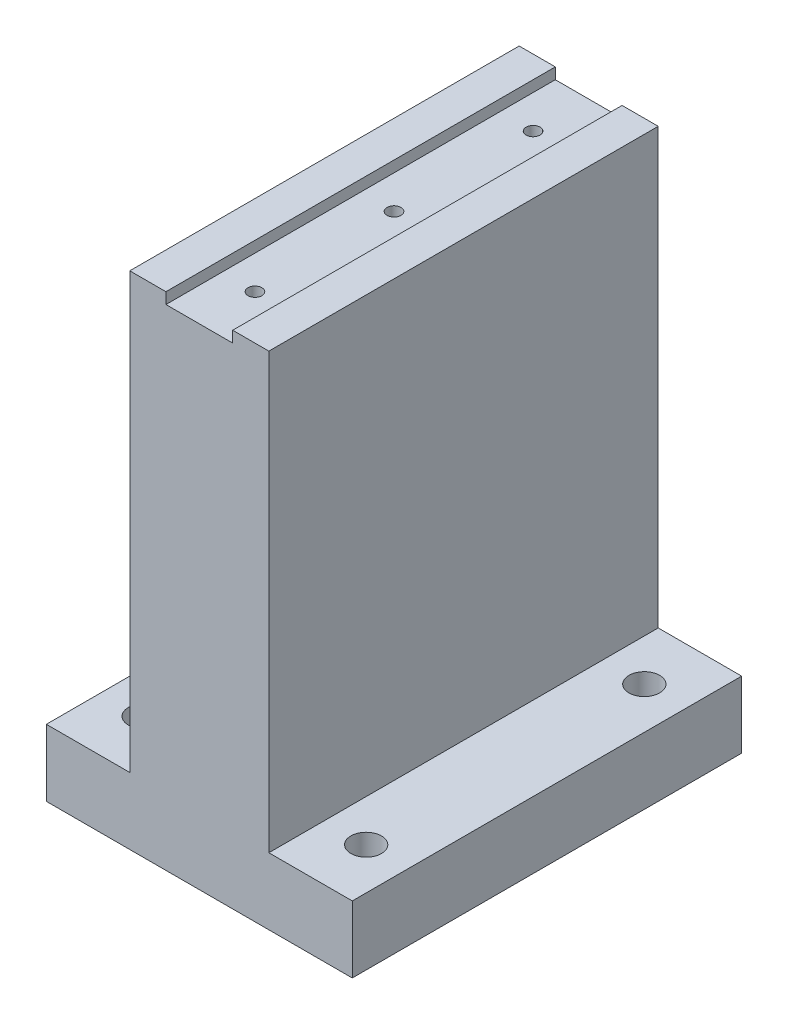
from build123d import *

# Parameters (mm, degrees)
EXTRUDE_1_DEPTH     = 70
SKETCH_2_R          = 2.75
CUT_EXTRUDE_1_DEPTH = 70
SKETCH_3_R          = 1.25
CUT_EXTRUDE_2_DEPTH = 15


with BuildPart() as part:
    # Sketch 1 → Extrude 1 (new body)
    with BuildSketch(Plane.XY):
        Polygon((21.5, 88.1), (21.5, 90.1), (15, 90.1), (15, 12), (0, 12), (0, 0), (55, 0), (55, 12), (40, 12), (40, 90.1), (33.5, 90.1), (33.5, 88.1), align=None)
    extrude(amount=EXTRUDE_1_DEPTH)

    # Sketch 2 → Cut-Extrude 1 (cut)
    with BuildSketch(Plane(origin=(0, 12, 0), x_dir=(1, 0, 0), z_dir=(0, 1, 0))):
        with Locations(Location((7.5, -10, 0), (0, 0, 270))):
            Circle(SKETCH_2_R)
        with Locations(Location((47.5, -10, 0), (0, 0, 270))):
            Circle(SKETCH_2_R)
        with Locations(Location((47.5, -60, 0), (0, 0, 270))):
            Circle(SKETCH_2_R)
        with Locations(Location((7.5, -60, 0), (0, 0, 270))):
            Circle(SKETCH_2_R)
    extrude(amount=-CUT_EXTRUDE_1_DEPTH, mode=Mode.SUBTRACT)

    # Sketch 3 → Cut-Extrude 2 (cut)
    with BuildSketch(Plane(origin=(0, 88.1, 0), x_dir=(1, 0, 0), z_dir=(0, 1, 0))):
        with Locations(Location((27.5, -10, 0), (0, 0, 270))):
            Circle(SKETCH_3_R)
        with Locations(Location((27.5, -35, 0), (0, 0, 270))):
            Circle(SKETCH_3_R)
        with Locations(Location((27.5, -60, 0), (0, 0, 270))):
            Circle(SKETCH_3_R)
    extrude(amount=-CUT_EXTRUDE_2_DEPTH, mode=Mode.SUBTRACT)


solid = part.part
